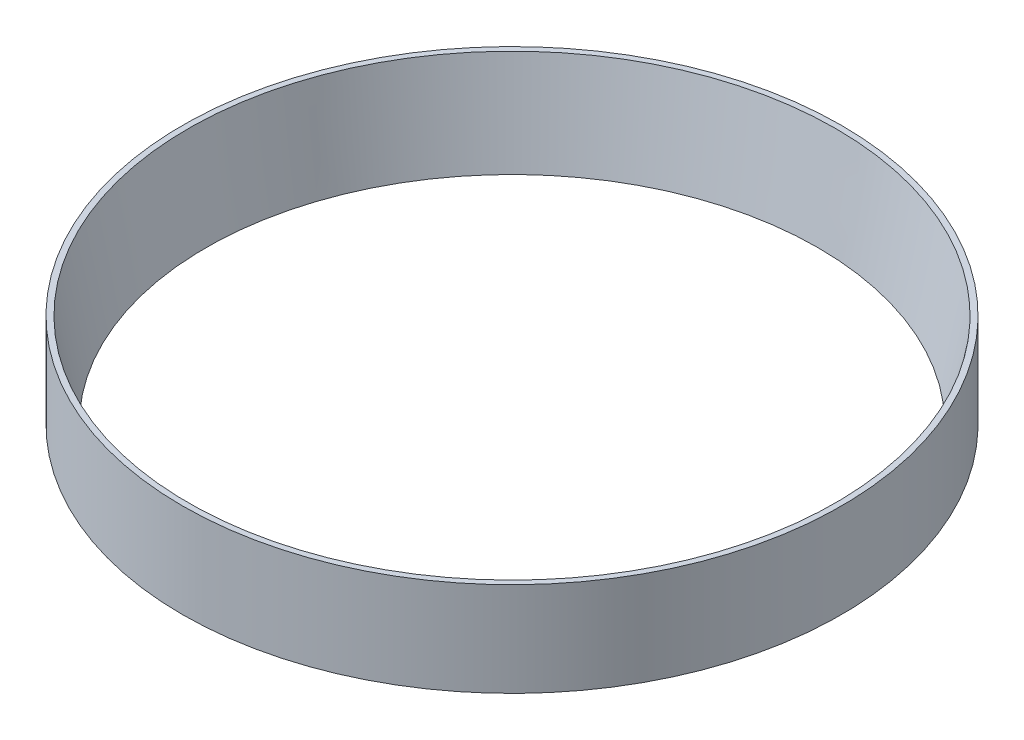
ISO-10303-21;
HEADER;
FILE_DESCRIPTION(('STEP AP214'),'2;1');
FILE_NAME('part.step','',(''),(''),'','','');
FILE_SCHEMA(('AUTOMOTIVE_DESIGN { 1 0 10303 214 1 1 1 1 }'));
ENDSEC;
DATA;
#1=APPLICATION_CONTEXT('core data for automotive mechanical design processes');
#2=APPLICATION_PROTOCOL_DEFINITION('international standard','automotive_design',2000,#1);
#3=PRODUCT_CONTEXT('',#1,'mechanical');
#4=PRODUCT('Part','Part','',(#3));
#5=PRODUCT_RELATED_PRODUCT_CATEGORY('part','',(#4));
#6=PRODUCT_DEFINITION_FORMATION('','',#4);
#7=PRODUCT_DEFINITION_CONTEXT('part definition',#1,'design');
#8=PRODUCT_DEFINITION('design','',#6,#7);
#9=PRODUCT_DEFINITION_SHAPE('','',#8);
#10=(LENGTH_UNIT() NAMED_UNIT(*) SI_UNIT(.MILLI.,.METRE.));
#11=(NAMED_UNIT(*) PLANE_ANGLE_UNIT() SI_UNIT($,.RADIAN.));
#12=(NAMED_UNIT(*) SI_UNIT($,.STERADIAN.) SOLID_ANGLE_UNIT());
#13=UNCERTAINTY_MEASURE_WITH_UNIT(LENGTH_MEASURE(1.E-05),#10,'distance_accuracy_value','');
#14=(GEOMETRIC_REPRESENTATION_CONTEXT(3) GLOBAL_UNCERTAINTY_ASSIGNED_CONTEXT((#13)) GLOBAL_UNIT_ASSIGNED_CONTEXT((#10,
#11,#12)) REPRESENTATION_CONTEXT('',''));
#15=CARTESIAN_POINT('',(0.,0.,0.));
#16=DIRECTION('',(0.,0.,1.));
#17=DIRECTION('',(1.,0.,0.));
#18=AXIS2_PLACEMENT_3D('',#15,#16,#17);
#19=CARTESIAN_POINT('',(0.,12.7,0.));
#20=DIRECTION('',(0.,1.,0.));
#21=DIRECTION('',(0.,0.,1.));
#22=AXIS2_PLACEMENT_3D('',#19,#20,#21);
#23=PLANE('',#22);
#24=CARTESIAN_POINT('',(0.,12.7,0.));
#25=DIRECTION('',(0.,-1.,0.));
#26=DIRECTION('',(0.,0.,-1.));
#27=AXIS2_PLACEMENT_3D('',#24,#25,#26);
#28=CIRCLE('',#27,43.688);
#29=CARTESIAN_POINT('',(0.,12.7,-43.688));
#30=VERTEX_POINT('',#29);
#31=EDGE_CURVE('E55',#30,#30,#28,.T.);
#32=ORIENTED_EDGE('',*,*,#31,.T.);
#33=EDGE_LOOP('',(#32));
#34=FACE_BOUND('',#33,.T.);
#35=CARTESIAN_POINT('',(0.,12.7,0.));
#36=DIRECTION('',(0.,1.,0.));
#37=DIRECTION('',(0.,0.,1.));
#38=AXIS2_PLACEMENT_3D('',#35,#36,#37);
#39=CIRCLE('',#38,44.45);
#40=CARTESIAN_POINT('',(0.,12.7,44.45));
#41=VERTEX_POINT('',#40);
#42=EDGE_CURVE('E10',#41,#41,#39,.T.);
#43=ORIENTED_EDGE('',*,*,#42,.T.);
#44=EDGE_LOOP('',(#43));
#45=FACE_BOUND('',#44,.T.);
#46=ADVANCED_FACE('F37',(#34,#45),#23,.T.);
#47=CARTESIAN_POINT('',(0.,0.,0.));
#48=DIRECTION('',(0.,1.,0.));
#49=DIRECTION('',(0.,0.,1.));
#50=AXIS2_PLACEMENT_3D('',#47,#48,#49);
#51=PLANE('',#50);
#52=CARTESIAN_POINT('',(0.,0.,0.));
#53=DIRECTION('',(0.,1.,0.));
#54=DIRECTION('',(0.,0.,1.));
#55=AXIS2_PLACEMENT_3D('',#52,#53,#54);
#56=CIRCLE('',#55,44.45);
#57=CARTESIAN_POINT('',(0.,0.,44.45));
#58=VERTEX_POINT('',#57);
#59=EDGE_CURVE('E41',#58,#58,#56,.T.);
#60=ORIENTED_EDGE('',*,*,#59,.F.);
#61=EDGE_LOOP('',(#60));
#62=FACE_BOUND('',#61,.T.);
#63=CARTESIAN_POINT('',(0.,0.,0.));
#64=DIRECTION('',(0.,-1.,0.));
#65=DIRECTION('',(0.,0.,-1.));
#66=AXIS2_PLACEMENT_3D('',#63,#64,#65);
#67=CIRCLE('',#66,41.275);
#68=CARTESIAN_POINT('',(0.,0.,-41.275));
#69=VERTEX_POINT('',#68);
#70=EDGE_CURVE('E50',#69,#69,#67,.T.);
#71=ORIENTED_EDGE('',*,*,#70,.F.);
#72=EDGE_LOOP('',(#71));
#73=FACE_BOUND('',#72,.T.);
#74=ADVANCED_FACE('F68',(#62,#73),#51,.F.);
#75=CARTESIAN_POINT('',(0.,12.7,0.));
#76=DIRECTION('',(0.,-1.,0.));
#77=DIRECTION('',(0.,0.,-1.));
#78=AXIS2_PLACEMENT_3D('',#75,#76,#77);
#79=CYLINDRICAL_SURFACE('',#78,44.45);
#80=ORIENTED_EDGE('',*,*,#42,.F.);
#81=EDGE_LOOP('',(#80));
#82=FACE_BOUND('',#81,.T.);
#83=ORIENTED_EDGE('',*,*,#59,.T.);
#84=EDGE_LOOP('',(#83));
#85=FACE_BOUND('',#84,.T.);
#86=ADVANCED_FACE('F39',(#82,#85),#79,.T.);
#87=CARTESIAN_POINT('',(0.,12.7,0.));
#88=DIRECTION('',(0.,1.,0.));
#89=DIRECTION('',(0.,0.,1.));
#90=AXIS2_PLACEMENT_3D('',#87,#88,#89);
#91=CONICAL_SURFACE('',#90,43.688,0.187761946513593);
#92=ORIENTED_EDGE('',*,*,#70,.T.);
#93=EDGE_LOOP('',(#92));
#94=FACE_BOUND('',#93,.T.);
#95=ORIENTED_EDGE('',*,*,#31,.F.);
#96=EDGE_LOOP('',(#95));
#97=FACE_BOUND('',#96,.T.);
#98=ADVANCED_FACE('F61',(#94,#97),#91,.F.);
#99=CLOSED_SHELL('',(#46,#74,#86,#98));
#100=MANIFOLD_SOLID_BREP('B2',#99);
#101=ADVANCED_BREP_SHAPE_REPRESENTATION('',(#18,#100),#14);
#102=SHAPE_DEFINITION_REPRESENTATION(#9,#101);
ENDSEC;
END-ISO-10303-21;
